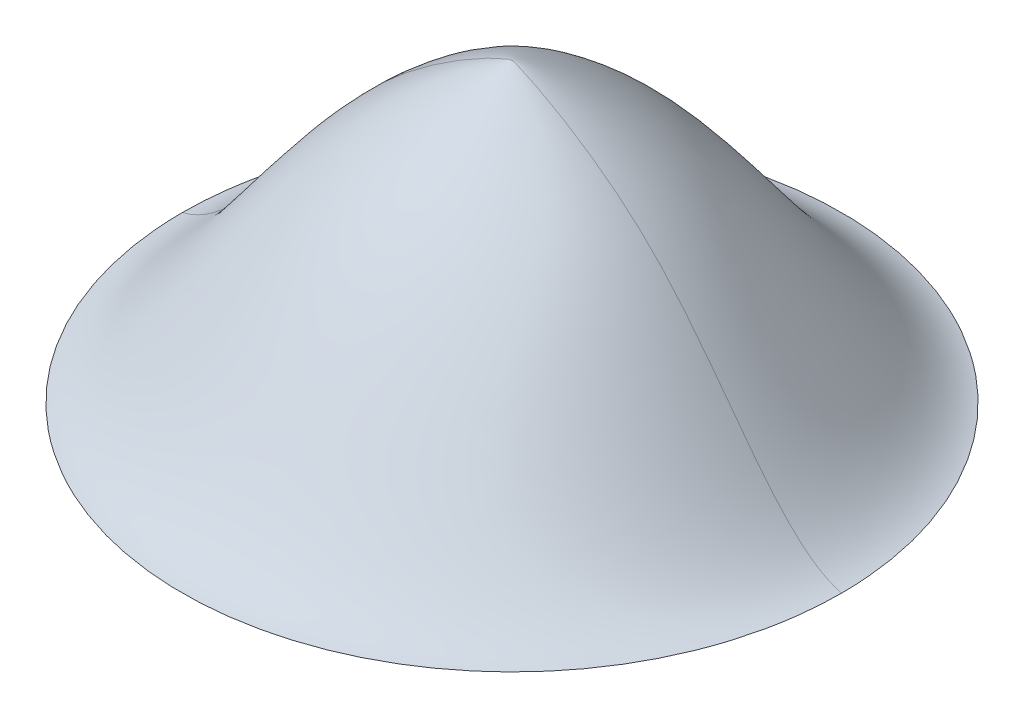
ISO-10303-21;
HEADER;
FILE_DESCRIPTION(('STEP AP214'),'2;1');
FILE_NAME('part.step','',(''),(''),'','','');
FILE_SCHEMA(('AUTOMOTIVE_DESIGN { 1 0 10303 214 1 1 1 1 }'));
ENDSEC;
DATA;
#1=APPLICATION_CONTEXT('core data for automotive mechanical design processes');
#2=APPLICATION_PROTOCOL_DEFINITION('international standard','automotive_design',2000,#1);
#3=PRODUCT_CONTEXT('',#1,'mechanical');
#4=PRODUCT('Part','Part','',(#3));
#5=PRODUCT_RELATED_PRODUCT_CATEGORY('part','',(#4));
#6=PRODUCT_DEFINITION_FORMATION('','',#4);
#7=PRODUCT_DEFINITION_CONTEXT('part definition',#1,'design');
#8=PRODUCT_DEFINITION('design','',#6,#7);
#9=PRODUCT_DEFINITION_SHAPE('','',#8);
#10=(LENGTH_UNIT() NAMED_UNIT(*) SI_UNIT(.MILLI.,.METRE.));
#11=(NAMED_UNIT(*) PLANE_ANGLE_UNIT() SI_UNIT($,.RADIAN.));
#12=(NAMED_UNIT(*) SI_UNIT($,.STERADIAN.) SOLID_ANGLE_UNIT());
#13=UNCERTAINTY_MEASURE_WITH_UNIT(LENGTH_MEASURE(1.E-05),#10,'distance_accuracy_value','');
#14=(GEOMETRIC_REPRESENTATION_CONTEXT(3) GLOBAL_UNCERTAINTY_ASSIGNED_CONTEXT((#13)) GLOBAL_UNIT_ASSIGNED_CONTEXT((#10,
#11,#12)) REPRESENTATION_CONTEXT('',''));
#15=CARTESIAN_POINT('',(0.,0.,0.));
#16=DIRECTION('',(0.,0.,1.));
#17=DIRECTION('',(1.,0.,0.));
#18=AXIS2_PLACEMENT_3D('',#15,#16,#17);
#19=CARTESIAN_POINT('',(-1.,0.,0.));
#20=CARTESIAN_POINT('',(-1.,0.,2.));
#21=CARTESIAN_POINT('',(1.,0.,2.));
#22=CARTESIAN_POINT('',(1.,0.,0.));
#23=CARTESIAN_POINT('',(-0.805593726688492,0.046970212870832,0.));
#24=CARTESIAN_POINT('',(-0.805593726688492,0.046970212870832,1.61118745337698));
#25=CARTESIAN_POINT('',(0.805593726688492,0.0469702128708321,1.61118745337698));
#26=CARTESIAN_POINT('',(0.805593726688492,0.0469702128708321,0.));
#27=CARTESIAN_POINT('',(-0.530824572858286,0.655683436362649,0.));
#28=CARTESIAN_POINT('',(-0.530824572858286,0.655683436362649,1.06164914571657));
#29=CARTESIAN_POINT('',(0.530824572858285,0.655683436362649,1.06164914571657));
#30=CARTESIAN_POINT('',(0.530824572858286,0.655683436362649,0.));
#31=CARTESIAN_POINT('',(-0.0210896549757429,0.9,0.));
#32=CARTESIAN_POINT('',(-0.0210896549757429,0.9,0.0421793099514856));
#33=CARTESIAN_POINT('',(0.0210896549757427,0.9,0.0421793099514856));
#34=CARTESIAN_POINT('',(0.0210896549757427,0.9,0.));
#35=CARTESIAN_POINT('',(0.,0.9,0.));
#36=CARTESIAN_POINT('',(0.,0.9,0.));
#37=CARTESIAN_POINT('',(0.,0.9,0.));
#38=CARTESIAN_POINT('',(0.,0.9,0.));
#39=(BOUNDED_SURFACE() B_SPLINE_SURFACE(3,3,((#19,#20,#21,#22),(#23,#24,#25,#26),(#27,#28,#29,
#30),(#31,#32,#33,#34),(#35,#36,#37,#38)),.UNSPECIFIED.,.F.,.F.,
.F.) B_SPLINE_SURFACE_WITH_KNOTS((4,1,4),(4,4),(0.,0.589485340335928,1.),(0.,1.),
.UNSPECIFIED.) GEOMETRIC_REPRESENTATION_ITEM() RATIONAL_B_SPLINE_SURFACE(((1.,0.333333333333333,
0.333333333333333,1.),(1.,0.333333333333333,0.333333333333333,1.),(1.,0.333333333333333,
0.333333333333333,1.),(1.,0.333333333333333,0.333333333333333,1.),(1.,0.333333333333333,
0.333333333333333,1.))) REPRESENTATION_ITEM('') SURFACE());
#40=CARTESIAN_POINT('',(-1.,0.,0.));
#41=CARTESIAN_POINT('',(-0.9999984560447,0.,0.0276619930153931));
#42=CARTESIAN_POINT('',(-0.998851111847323,0.,0.0553062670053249));
#43=CARTESIAN_POINT('',(-0.994267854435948,0.,0.110454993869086));
#44=CARTESIAN_POINT('',(-0.990827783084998,0.,0.137959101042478));
#45=CARTESIAN_POINT('',(-0.976967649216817,0.,0.220618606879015));
#46=CARTESIAN_POINT('',(-0.9630072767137,0.,0.275238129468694));
#47=CARTESIAN_POINT('',(-0.935379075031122,0.,0.354766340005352));
#48=CARTESIAN_POINT('',(-0.925045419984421,0.,0.380893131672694));
#49=CARTESIAN_POINT('',(-0.902209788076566,0.,0.432211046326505));
#50=CARTESIAN_POINT('',(-0.889705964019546,0.,0.457401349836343));
#51=CARTESIAN_POINT('',(-0.849064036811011,0.,0.531265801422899));
#52=CARTESIAN_POINT('',(-0.81778663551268,0.,0.57825887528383));
#53=CARTESIAN_POINT('',(-0.747800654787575,0.,0.66630387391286));
#54=CARTESIAN_POINT('',(-0.709091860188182,0.,0.707355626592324));
#55=CARTESIAN_POINT('',(-0.625328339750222,0.,0.782383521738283));
#56=CARTESIAN_POINT('',(-0.58027373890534,0.,0.816359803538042));
#57=CARTESIAN_POINT('',(-0.485100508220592,0.,0.876264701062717));
#58=CARTESIAN_POINT('',(-0.434981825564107,0.,0.902193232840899));
#59=CARTESIAN_POINT('',(-0.331103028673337,0.,0.945268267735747));
#60=CARTESIAN_POINT('',(-0.277342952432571,0.,0.962414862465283));
#61=CARTESIAN_POINT('',(-0.167706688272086,0.,0.987439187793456));
#62=CARTESIAN_POINT('',(-0.11183047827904,0.,0.995316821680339));
#63=CARTESIAN_POINT('',(0.000451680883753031,0.,1.00157946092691));
#64=CARTESIAN_POINT('',(0.0568576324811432,0.,0.999964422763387));
#65=CARTESIAN_POINT('',(0.168596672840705,0.,0.987287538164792));
#66=CARTESIAN_POINT('',(0.223929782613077,0.,0.976225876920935));
#67=CARTESIAN_POINT('',(0.331952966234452,0.,0.944970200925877));
#68=CARTESIAN_POINT('',(0.384643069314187,0.,0.924776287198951));
#69=CARTESIAN_POINT('',(0.485887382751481,0.,0.875828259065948));
#70=CARTESIAN_POINT('',(0.534441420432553,0.,0.847073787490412));
#71=CARTESIAN_POINT('',(0.62603196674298,0.,0.78182200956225));
#72=CARTESIAN_POINT('',(0.66906856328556,0.,0.745324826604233));
#73=CARTESIAN_POINT('',(0.748403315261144,0.,0.665622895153));
#74=CARTESIAN_POINT('',(0.784701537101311,0.,0.622418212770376));
#75=CARTESIAN_POINT('',(0.849531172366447,0.,0.530527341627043));
#76=CARTESIAN_POINT('',(0.878061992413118,0.,0.481840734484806));
#77=CARTESIAN_POINT('',(0.926543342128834,0.,0.380365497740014));
#78=CARTESIAN_POINT('',(0.946495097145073,0.,0.327577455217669));
#79=CARTESIAN_POINT('',(0.97450488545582,0.,0.229072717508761));
#80=CARTESIAN_POINT('',(0.98404867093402,0.,0.183771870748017));
#81=CARTESIAN_POINT('',(0.996803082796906,0.,0.0923192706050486));
#82=CARTESIAN_POINT('',(1.00001800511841,0.,0.0461681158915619));
#83=CARTESIAN_POINT('',(1.,0.,0.));
#84=B_SPLINE_CURVE_WITH_KNOTS('',3,(#40,#41,#42,#43,#44,#45,#46,#47,#48,#49,#50,#51,#52,#53,#54,
#55,#56,#57,#58,#59,#60,#61,#62,#63,#64,#65,#66,#67,#68,#69,#70,#71,#72,#73,#74,#75,#76,#77,#78,
#79,#80,#81,#82,#83),.UNSPECIFIED.,.F.,.F.,(4,2,2,2,2,2,2,2,2,2,2,2,2,2,2,2,2,2,2,2,2,4),(0.,
0.0829268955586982,0.166004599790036,0.334184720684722,0.418393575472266,0.502674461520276,
0.671156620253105,0.839643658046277,1.00812737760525,1.17661285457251,1.34509657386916,
1.51358205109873,1.68206830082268,1.85055124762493,2.01903233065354,2.18752044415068,
2.35600587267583,2.5244896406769,2.69298627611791,2.86145883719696,2.99991438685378,
3.13827592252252),.UNSPECIFIED.);
#85=CARTESIAN_POINT('',(-1.,0.,0.));
#86=VERTEX_POINT('',#85);
#87=CARTESIAN_POINT('',(1.,0.,0.));
#88=VERTEX_POINT('',#87);
#89=EDGE_CURVE('E23',#86,#88,#84,.T.);
#90=CARTESIAN_POINT('',(1.,0.,0.));
#91=CARTESIAN_POINT('',(0.805593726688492,0.0469702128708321,0.));
#92=CARTESIAN_POINT('',(0.530824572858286,0.655683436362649,0.));
#93=CARTESIAN_POINT('',(0.0210896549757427,0.9,0.));
#94=CARTESIAN_POINT('',(0.,0.9,0.));
#95=B_SPLINE_CURVE_WITH_KNOTS('',3,(#90,#91,#92,#93,#94),.UNSPECIFIED.,.F.,.F.,(4,1,4),(0.,
0.589485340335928,1.),.UNSPECIFIED.);
#96=CARTESIAN_POINT('',(0.,0.9,0.));
#97=VERTEX_POINT('',#96);
#98=EDGE_CURVE('E37',#88,#97,#95,.T.);
#99=CARTESIAN_POINT('',(-1.,0.,0.));
#100=CARTESIAN_POINT('',(-0.805593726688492,0.046970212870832,0.));
#101=CARTESIAN_POINT('',(-0.530824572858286,0.655683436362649,0.));
#102=CARTESIAN_POINT('',(-0.0210896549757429,0.9,0.));
#103=CARTESIAN_POINT('',(0.,0.9,0.));
#104=B_SPLINE_CURVE_WITH_KNOTS('',3,(#99,#100,#101,#102,#103),.UNSPECIFIED.,.F.,.F.,(4,1,4),(0.,
0.589485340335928,1.),.UNSPECIFIED.);
#105=EDGE_CURVE('E45',#97,#86,#104,.F.);
#106=ORIENTED_EDGE('',*,*,#89,.T.);
#107=ORIENTED_EDGE('',*,*,#98,.T.);
#108=ORIENTED_EDGE('',*,*,#105,.T.);
#109=EDGE_LOOP('',(#106,#107,#108));
#110=FACE_BOUND('',#109,.T.);
#111=ADVANCED_FACE('F17',(#110),#39,.F.);
#112=CARTESIAN_POINT('',(1.,0.,0.));
#113=CARTESIAN_POINT('',(1.,0.,-2.));
#114=CARTESIAN_POINT('',(-1.,0.,-2.));
#115=CARTESIAN_POINT('',(-1.,0.,0.));
#116=CARTESIAN_POINT('',(0.805593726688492,0.0469702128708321,0.));
#117=CARTESIAN_POINT('',(0.805593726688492,0.0469702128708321,-1.61118745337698));
#118=CARTESIAN_POINT('',(-0.805593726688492,0.046970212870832,-1.61118745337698));
#119=CARTESIAN_POINT('',(-0.805593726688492,0.046970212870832,0.));
#120=CARTESIAN_POINT('',(0.530824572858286,0.655683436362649,0.));
#121=CARTESIAN_POINT('',(0.530824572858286,0.655683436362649,-1.06164914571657));
#122=CARTESIAN_POINT('',(-0.530824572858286,0.655683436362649,-1.06164914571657));
#123=CARTESIAN_POINT('',(-0.530824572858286,0.655683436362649,0.));
#124=CARTESIAN_POINT('',(0.0210896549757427,0.9,0.));
#125=CARTESIAN_POINT('',(0.0210896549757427,0.9,-0.0421793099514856));
#126=CARTESIAN_POINT('',(-0.0210896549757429,0.9,-0.0421793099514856));
#127=CARTESIAN_POINT('',(-0.0210896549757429,0.9,0.));
#128=CARTESIAN_POINT('',(0.,0.9,0.));
#129=CARTESIAN_POINT('',(0.,0.9,0.));
#130=CARTESIAN_POINT('',(0.,0.9,0.));
#131=CARTESIAN_POINT('',(0.,0.9,0.));
#132=(BOUNDED_SURFACE() B_SPLINE_SURFACE(3,3,((#112,#113,#114,#115),(#116,#117,#118,#119),(#120,
#121,#122,#123),(#124,#125,#126,#127),(#128,#129,#130,#131)),.UNSPECIFIED.,.F.,.F.,
.F.) B_SPLINE_SURFACE_WITH_KNOTS((4,1,4),(4,4),(0.,0.589485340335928,1.),(0.,1.),
.UNSPECIFIED.) GEOMETRIC_REPRESENTATION_ITEM() RATIONAL_B_SPLINE_SURFACE(((1.,0.333333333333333,
0.333333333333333,1.),(1.,0.333333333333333,0.333333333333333,1.),(1.,0.333333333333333,
0.333333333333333,1.),(1.,0.333333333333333,0.333333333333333,1.),(1.,0.333333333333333,
0.333333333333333,1.))) REPRESENTATION_ITEM('') SURFACE());
#133=CARTESIAN_POINT('',(1.,0.,0.));
#134=CARTESIAN_POINT('',(0.9999984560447,0.,-0.0276619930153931));
#135=CARTESIAN_POINT('',(0.998851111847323,0.,-0.055306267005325));
#136=CARTESIAN_POINT('',(0.994267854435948,0.,-0.110454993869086));
#137=CARTESIAN_POINT('',(0.990827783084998,0.,-0.137959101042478));
#138=CARTESIAN_POINT('',(0.976967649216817,0.,-0.220618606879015));
#139=CARTESIAN_POINT('',(0.963007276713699,0.,-0.275238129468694));
#140=CARTESIAN_POINT('',(0.935379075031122,0.,-0.354766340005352));
#141=CARTESIAN_POINT('',(0.925045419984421,0.,-0.380893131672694));
#142=CARTESIAN_POINT('',(0.902209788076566,0.,-0.432211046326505));
#143=CARTESIAN_POINT('',(0.889705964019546,0.,-0.457401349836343));
#144=CARTESIAN_POINT('',(0.84906403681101,0.,-0.531265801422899));
#145=CARTESIAN_POINT('',(0.81778663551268,0.,-0.57825887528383));
#146=CARTESIAN_POINT('',(0.747800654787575,0.,-0.66630387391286));
#147=CARTESIAN_POINT('',(0.709091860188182,0.,-0.707355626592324));
#148=CARTESIAN_POINT('',(0.625328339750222,0.,-0.782383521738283));
#149=CARTESIAN_POINT('',(0.58027373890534,0.,-0.816359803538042));
#150=CARTESIAN_POINT('',(0.485100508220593,0.,-0.876264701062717));
#151=CARTESIAN_POINT('',(0.434981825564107,0.,-0.902193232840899));
#152=CARTESIAN_POINT('',(0.331103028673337,0.,-0.945268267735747));
#153=CARTESIAN_POINT('',(0.277342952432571,0.,-0.962414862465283));
#154=CARTESIAN_POINT('',(0.167706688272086,0.,-0.987439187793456));
#155=CARTESIAN_POINT('',(0.11183047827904,0.,-0.995316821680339));
#156=CARTESIAN_POINT('',(-0.000451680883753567,0.,-1.00157946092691));
#157=CARTESIAN_POINT('',(-0.0568576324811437,0.,-0.999964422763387));
#158=CARTESIAN_POINT('',(-0.168596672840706,0.,-0.987287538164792));
#159=CARTESIAN_POINT('',(-0.223929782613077,0.,-0.976225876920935));
#160=CARTESIAN_POINT('',(-0.331952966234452,0.,-0.944970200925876));
#161=CARTESIAN_POINT('',(-0.384643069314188,0.,-0.924776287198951));
#162=CARTESIAN_POINT('',(-0.485887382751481,0.,-0.875828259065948));
#163=CARTESIAN_POINT('',(-0.534441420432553,0.,-0.847073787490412));
#164=CARTESIAN_POINT('',(-0.62603196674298,0.,-0.78182200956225));
#165=CARTESIAN_POINT('',(-0.66906856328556,0.,-0.745324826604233));
#166=CARTESIAN_POINT('',(-0.748403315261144,0.,-0.665622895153));
#167=CARTESIAN_POINT('',(-0.784701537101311,0.,-0.622418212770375));
#168=CARTESIAN_POINT('',(-0.849531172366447,0.,-0.530527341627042));
#169=CARTESIAN_POINT('',(-0.878061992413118,0.,-0.481840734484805));
#170=CARTESIAN_POINT('',(-0.926543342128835,0.,-0.380365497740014));
#171=CARTESIAN_POINT('',(-0.946495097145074,0.,-0.327577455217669));
#172=CARTESIAN_POINT('',(-0.974504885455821,0.,-0.229072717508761));
#173=CARTESIAN_POINT('',(-0.984048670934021,0.,-0.183771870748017));
#174=CARTESIAN_POINT('',(-0.996803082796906,0.,-0.0923192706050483));
#175=CARTESIAN_POINT('',(-1.00001800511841,0.,-0.0461681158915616));
#176=CARTESIAN_POINT('',(-1.,0.,0.));
#177=B_SPLINE_CURVE_WITH_KNOTS('',3,(#133,#134,#135,#136,#137,#138,#139,#140,#141,#142,#143,
#144,#145,#146,#147,#148,#149,#150,#151,#152,#153,#154,#155,#156,#157,#158,#159,#160,#161,#162,
#163,#164,#165,#166,#167,#168,#169,#170,#171,#172,#173,#174,#175,#176),.UNSPECIFIED.,.F.,.F.,(4,
2,2,2,2,2,2,2,2,2,2,2,2,2,2,2,2,2,2,2,2,4),(0.,0.0829268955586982,0.166004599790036,
0.334184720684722,0.418393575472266,0.502674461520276,0.671156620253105,0.839643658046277,
1.00812737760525,1.17661285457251,1.34509657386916,1.51358205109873,1.68206830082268,
1.85055124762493,2.01903233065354,2.18752044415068,2.35600587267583,2.5244896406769,
2.69298627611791,2.86145883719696,2.99991438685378,3.13827592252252),.UNSPECIFIED.);
#178=EDGE_CURVE('E11',#88,#86,#177,.T.);
#179=ORIENTED_EDGE('',*,*,#105,.F.);
#180=ORIENTED_EDGE('',*,*,#98,.F.);
#181=ORIENTED_EDGE('',*,*,#178,.T.);
#182=EDGE_LOOP('',(#179,#180,#181));
#183=FACE_BOUND('',#182,.T.);
#184=ADVANCED_FACE('F46',(#183),#132,.F.);
#185=CARTESIAN_POINT('',(0.,0.,0.));
#186=DIRECTION('',(0.,1.,0.));
#187=DIRECTION('',(-1.,0.,0.));
#188=AXIS2_PLACEMENT_3D('',#185,#186,#187);
#189=PLANE('',#188);
#190=ORIENTED_EDGE('',*,*,#89,.F.);
#191=ORIENTED_EDGE('',*,*,#178,.F.);
#192=EDGE_LOOP('',(#190,#191));
#193=FACE_BOUND('',#192,.T.);
#194=ADVANCED_FACE('F67',(#193),#189,.F.);
#195=CLOSED_SHELL('',(#111,#184,#194));
#196=MANIFOLD_SOLID_BREP('B1',#195);
#197=ADVANCED_BREP_SHAPE_REPRESENTATION('',(#18,#196),#14);
#198=SHAPE_DEFINITION_REPRESENTATION(#9,#197);
ENDSEC;
END-ISO-10303-21;
